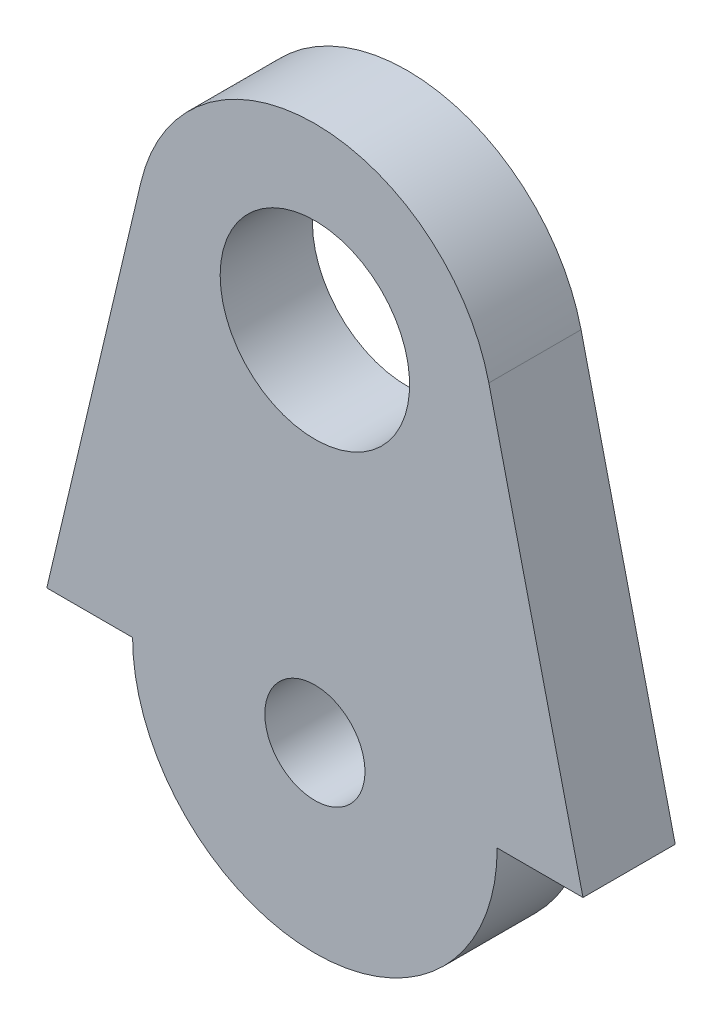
from build123d import *

# Parameters (mm, degrees)
SKETCH1_R           = 1.778
SKETCH1_R_2         = 3.3655
BOSS_EXTRUDE1_DEPTH = 1.6383


with BuildPart() as part:
    # Sketch1 → Boss-Extrude1 (new, symmetric)
    with BuildSketch(Plane.XY):
        with BuildLine():
            Line((6.477, 0), (9.525, 0))
            Line((9.525, 0), (6.179896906, 14.15992268))
            ThreePointArc((6.179896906, 14.15992268), (0, 19.05), (-6.179896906, 14.15992268))
            Line((-6.179896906, 14.15992268), (-9.525, 0))
            Line((-9.525, 0), (-6.477, 0))
            ThreePointArc((-6.477, 0), (0, -6.477), (6.477, 0))
        make_face()
        with Locations(Location((0, 0, 0), (0, 0, 180))):
            Circle(SKETCH1_R, mode=Mode.SUBTRACT)
        with Locations(Location((0, 12.7, 0), (0, 0, 180))):
            Circle(SKETCH1_R_2, mode=Mode.SUBTRACT)
    extrude(amount=BOSS_EXTRUDE1_DEPTH, both=True)


solid = part.part
